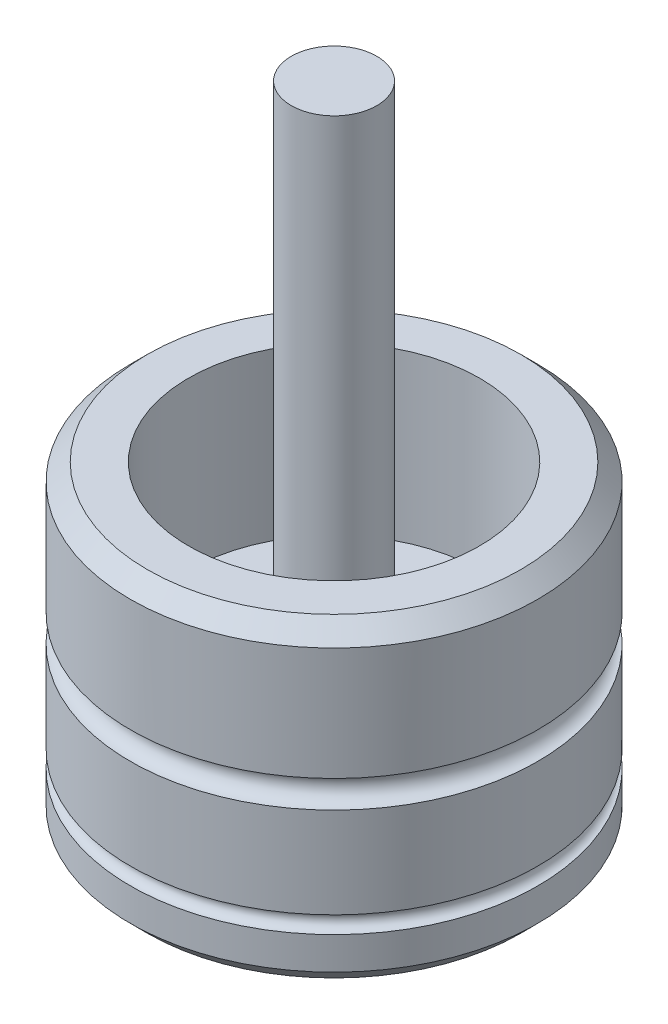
ISO-10303-21;
HEADER;
FILE_DESCRIPTION(('STEP AP214'),'2;1');
FILE_NAME('part.step','',(''),(''),'','','');
FILE_SCHEMA(('AUTOMOTIVE_DESIGN { 1 0 10303 214 1 1 1 1 }'));
ENDSEC;
DATA;
#1=APPLICATION_CONTEXT('core data for automotive mechanical design processes');
#2=APPLICATION_PROTOCOL_DEFINITION('international standard','automotive_design',2000,#1);
#3=PRODUCT_CONTEXT('',#1,'mechanical');
#4=PRODUCT('Part','Part','',(#3));
#5=PRODUCT_RELATED_PRODUCT_CATEGORY('part','',(#4));
#6=PRODUCT_DEFINITION_FORMATION('','',#4);
#7=PRODUCT_DEFINITION_CONTEXT('part definition',#1,'design');
#8=PRODUCT_DEFINITION('design','',#6,#7);
#9=PRODUCT_DEFINITION_SHAPE('','',#8);
#10=(LENGTH_UNIT() NAMED_UNIT(*) SI_UNIT(.MILLI.,.METRE.));
#11=(NAMED_UNIT(*) PLANE_ANGLE_UNIT() SI_UNIT($,.RADIAN.));
#12=(NAMED_UNIT(*) SI_UNIT($,.STERADIAN.) SOLID_ANGLE_UNIT());
#13=UNCERTAINTY_MEASURE_WITH_UNIT(LENGTH_MEASURE(1.E-05),#10,'distance_accuracy_value','');
#14=(GEOMETRIC_REPRESENTATION_CONTEXT(3) GLOBAL_UNCERTAINTY_ASSIGNED_CONTEXT((#13)) GLOBAL_UNIT_ASSIGNED_CONTEXT((#10,
#11,#12)) REPRESENTATION_CONTEXT('',''));
#15=CARTESIAN_POINT('',(0.,0.,0.));
#16=DIRECTION('',(0.,0.,1.));
#17=DIRECTION('',(1.,0.,0.));
#18=AXIS2_PLACEMENT_3D('',#15,#16,#17);
#19=CARTESIAN_POINT('',(0.,11.0264727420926,-10.7949999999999));
#20=DIRECTION('',(0.,1.,0.));
#21=DIRECTION('',(0.,0.,1.));
#22=AXIS2_PLACEMENT_3D('',#19,#20,#21);
#23=PLANE('',#22);
#24=CARTESIAN_POINT('',(0.,11.0264727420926,0.));
#25=DIRECTION('',(0.,-1.,0.));
#26=DIRECTION('',(0.,0.,-1.));
#27=AXIS2_PLACEMENT_3D('',#24,#25,#26);
#28=CIRCLE('',#27,10.795);
#29=CARTESIAN_POINT('',(0.,11.0264727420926,-10.795));
#30=VERTEX_POINT('',#29);
#31=EDGE_CURVE('E72',#30,#30,#28,.T.);
#32=ORIENTED_EDGE('',*,*,#31,.F.);
#33=EDGE_LOOP('',(#32));
#34=FACE_BOUND('',#33,.T.);
#35=CARTESIAN_POINT('',(0.,11.0264727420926,0.));
#36=DIRECTION('',(0.,1.,0.));
#37=DIRECTION('',(0.,0.,1.));
#38=AXIS2_PLACEMENT_3D('',#35,#36,#37);
#39=CIRCLE('',#38,3.175);
#40=CARTESIAN_POINT('',(0.,11.0264727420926,3.175));
#41=VERTEX_POINT('',#40);
#42=EDGE_CURVE('E76',#41,#41,#39,.T.);
#43=ORIENTED_EDGE('',*,*,#42,.F.);
#44=EDGE_LOOP('',(#43));
#45=FACE_BOUND('',#44,.T.);
#46=ADVANCED_FACE('F37',(#34,#45),#23,.T.);
#47=CARTESIAN_POINT('',(0.,0.,0.));
#48=DIRECTION('',(0.,-1.,0.));
#49=DIRECTION('',(0.,0.,-1.));
#50=AXIS2_PLACEMENT_3D('',#47,#48,#49);
#51=PLANE('',#50);
#52=CARTESIAN_POINT('',(0.,0.,0.));
#53=DIRECTION('',(0.,-1.,0.));
#54=DIRECTION('',(0.,0.,-1.));
#55=AXIS2_PLACEMENT_3D('',#52,#53,#54);
#56=CIRCLE('',#55,13.843);
#57=CARTESIAN_POINT('',(0.,0.,-13.843));
#58=VERTEX_POINT('',#57);
#59=EDGE_CURVE('E52',#58,#58,#56,.T.);
#60=ORIENTED_EDGE('',*,*,#59,.T.);
#61=EDGE_LOOP('',(#60));
#62=FACE_BOUND('',#61,.T.);
#63=ADVANCED_FACE('F91',(#62),#51,.T.);
#64=CARTESIAN_POINT('',(0.,0.,0.));
#65=DIRECTION('',(0.,-1.,0.));
#66=DIRECTION('',(0.,0.,-1.));
#67=AXIS2_PLACEMENT_3D('',#64,#65,#66);
#68=CYLINDRICAL_SURFACE('',#67,15.113);
#69=CARTESIAN_POINT('',(0.,1.27000000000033,0.));
#70=DIRECTION('',(0.,-1.,0.));
#71=DIRECTION('',(0.,0.,-1.));
#72=AXIS2_PLACEMENT_3D('',#69,#70,#71);
#73=CIRCLE('',#72,15.113);
#74=CARTESIAN_POINT('',(0.,1.27000000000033,-15.113));
#75=VERTEX_POINT('',#74);
#76=EDGE_CURVE('E48',#75,#75,#73,.F.);
#77=ORIENTED_EDGE('',*,*,#76,.T.);
#78=EDGE_LOOP('',(#77));
#79=FACE_BOUND('',#78,.T.);
#80=CARTESIAN_POINT('',(0.,3.68300000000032,0.));
#81=DIRECTION('',(0.,-1.,0.));
#82=DIRECTION('',(0.,0.,-1.));
#83=AXIS2_PLACEMENT_3D('',#80,#81,#82);
#84=CIRCLE('',#83,15.113);
#85=CARTESIAN_POINT('',(0.,3.68300000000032,-15.113));
#86=VERTEX_POINT('',#85);
#87=EDGE_CURVE('E57',#86,#86,#84,.T.);
#88=ORIENTED_EDGE('',*,*,#87,.T.);
#89=EDGE_LOOP('',(#88));
#90=FACE_BOUND('',#89,.T.);
#91=ADVANCED_FACE('F97',(#79,#90),#68,.T.);
#92=CARTESIAN_POINT('',(0.,4.31800000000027,0.));
#93=DIRECTION('',(0.,-1.,0.));
#94=DIRECTION('',(0.,0.,-1.));
#95=AXIS2_PLACEMENT_3D('',#92,#93,#94);
#96=TOROIDAL_SURFACE('',#95,15.113,0.634999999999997);
#97=CARTESIAN_POINT('',(0.,4.95300000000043,0.));
#98=DIRECTION('',(0.,-1.,0.));
#99=DIRECTION('',(0.,0.,-1.));
#100=AXIS2_PLACEMENT_3D('',#97,#98,#99);
#101=CIRCLE('',#100,15.113);
#102=CARTESIAN_POINT('',(0.,4.95300000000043,-15.113));
#103=VERTEX_POINT('',#102);
#104=EDGE_CURVE('E60',#103,#103,#101,.T.);
#105=ORIENTED_EDGE('',*,*,#104,.T.);
#106=EDGE_LOOP('',(#105));
#107=FACE_BOUND('',#106,.T.);
#108=ORIENTED_EDGE('',*,*,#87,.F.);
#109=EDGE_LOOP('',(#108));
#110=FACE_BOUND('',#109,.T.);
#111=ADVANCED_FACE('F121',(#107,#110),#96,.F.);
#112=CARTESIAN_POINT('',(0.,0.,0.));
#113=DIRECTION('',(0.,-1.,0.));
#114=DIRECTION('',(0.,0.,-1.));
#115=AXIS2_PLACEMENT_3D('',#112,#113,#114);
#116=CYLINDRICAL_SURFACE('',#115,15.113);
#117=CARTESIAN_POINT('',(0.,11.684,0.));
#118=DIRECTION('',(0.,-1.,0.));
#119=DIRECTION('',(0.,0.,-1.));
#120=AXIS2_PLACEMENT_3D('',#117,#118,#119);
#121=CIRCLE('',#120,15.113);
#122=CARTESIAN_POINT('',(0.,11.684,-15.113));
#123=VERTEX_POINT('',#122);
#124=EDGE_CURVE('E63',#123,#123,#121,.T.);
#125=ORIENTED_EDGE('',*,*,#124,.T.);
#126=EDGE_LOOP('',(#125));
#127=FACE_BOUND('',#126,.T.);
#128=ORIENTED_EDGE('',*,*,#104,.F.);
#129=EDGE_LOOP('',(#128));
#130=FACE_BOUND('',#129,.T.);
#131=ADVANCED_FACE('F117',(#127,#130),#116,.T.);
#132=CARTESIAN_POINT('',(0.,12.7000000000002,-2.22044604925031E-13));
#133=DIRECTION('',(0.,-1.,0.));
#134=DIRECTION('',(0.,0.,-1.));
#135=AXIS2_PLACEMENT_3D('',#132,#133,#134);
#136=TOROIDAL_SURFACE('',#135,15.113,1.016);
#137=CARTESIAN_POINT('',(0.,13.7160000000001,0.));
#138=DIRECTION('',(0.,-1.,0.));
#139=DIRECTION('',(0.,0.,-1.));
#140=AXIS2_PLACEMENT_3D('',#137,#138,#139);
#141=CIRCLE('',#140,15.113);
#142=CARTESIAN_POINT('',(0.,13.7160000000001,-15.113));
#143=VERTEX_POINT('',#142);
#144=EDGE_CURVE('E66',#143,#143,#141,.T.);
#145=ORIENTED_EDGE('',*,*,#144,.T.);
#146=EDGE_LOOP('',(#145));
#147=FACE_BOUND('',#146,.T.);
#148=ORIENTED_EDGE('',*,*,#124,.F.);
#149=EDGE_LOOP('',(#148));
#150=FACE_BOUND('',#149,.T.);
#151=ADVANCED_FACE('F114',(#147,#150),#136,.F.);
#152=CARTESIAN_POINT('',(0.,0.,0.));
#153=DIRECTION('',(0.,-1.,0.));
#154=DIRECTION('',(0.,0.,-1.));
#155=AXIS2_PLACEMENT_3D('',#152,#153,#154);
#156=CYLINDRICAL_SURFACE('',#155,15.113);
#157=CARTESIAN_POINT('',(0.,22.0980000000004,2.22044604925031E-13));
#158=DIRECTION('',(0.,1.,0.));
#159=DIRECTION('',(0.,0.,1.));
#160=AXIS2_PLACEMENT_3D('',#157,#158,#159);
#161=CIRCLE('',#160,15.113);
#162=CARTESIAN_POINT('',(0.,22.0980000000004,15.1130000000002));
#163=VERTEX_POINT('',#162);
#164=EDGE_CURVE('E44',#163,#163,#161,.F.);
#165=ORIENTED_EDGE('',*,*,#164,.T.);
#166=EDGE_LOOP('',(#165));
#167=FACE_BOUND('',#166,.T.);
#168=ORIENTED_EDGE('',*,*,#144,.F.);
#169=EDGE_LOOP('',(#168));
#170=FACE_BOUND('',#169,.T.);
#171=ADVANCED_FACE('F111',(#167,#170),#156,.T.);
#172=CARTESIAN_POINT('',(0.,23.3680000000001,-15.1130000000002));
#173=DIRECTION('',(0.,1.,0.));
#174=DIRECTION('',(0.,0.,1.));
#175=AXIS2_PLACEMENT_3D('',#172,#173,#174);
#176=PLANE('',#175);
#177=CARTESIAN_POINT('',(0.,23.3680000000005,0.));
#178=DIRECTION('',(0.,1.,0.));
#179=DIRECTION('',(0.,0.,1.));
#180=AXIS2_PLACEMENT_3D('',#177,#178,#179);
#181=CIRCLE('',#180,13.843);
#182=CARTESIAN_POINT('',(0.,23.3680000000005,13.843));
#183=VERTEX_POINT('',#182);
#184=EDGE_CURVE('E10',#183,#183,#181,.T.);
#185=ORIENTED_EDGE('',*,*,#184,.T.);
#186=EDGE_LOOP('',(#185));
#187=FACE_BOUND('',#186,.T.);
#188=CARTESIAN_POINT('',(0.,23.3680000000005,0.));
#189=DIRECTION('',(0.,-1.,0.));
#190=DIRECTION('',(0.,0.,-1.));
#191=AXIS2_PLACEMENT_3D('',#188,#189,#190);
#192=CIRCLE('',#191,10.795);
#193=CARTESIAN_POINT('',(0.,23.3680000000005,-10.795));
#194=VERTEX_POINT('',#193);
#195=EDGE_CURVE('E69',#194,#194,#192,.T.);
#196=ORIENTED_EDGE('',*,*,#195,.T.);
#197=EDGE_LOOP('',(#196));
#198=FACE_BOUND('',#197,.T.);
#199=ADVANCED_FACE('F107',(#187,#198),#176,.T.);
#200=CARTESIAN_POINT('',(0.,0.,0.));
#201=DIRECTION('',(0.,-1.,0.));
#202=DIRECTION('',(0.,0.,-1.));
#203=AXIS2_PLACEMENT_3D('',#200,#201,#202);
#204=CYLINDRICAL_SURFACE('',#203,10.795);
#205=ORIENTED_EDGE('',*,*,#31,.T.);
#206=EDGE_LOOP('',(#205));
#207=FACE_BOUND('',#206,.T.);
#208=ORIENTED_EDGE('',*,*,#195,.F.);
#209=EDGE_LOOP('',(#208));
#210=FACE_BOUND('',#209,.T.);
#211=ADVANCED_FACE('F103',(#207,#210),#204,.F.);
#212=CARTESIAN_POINT('',(0.,0.,0.));
#213=DIRECTION('',(0.,1.,0.));
#214=DIRECTION('',(0.,0.,1.));
#215=AXIS2_PLACEMENT_3D('',#212,#213,#214);
#216=CONICAL_SURFACE('',#215,13.843,0.785398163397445);
#217=ORIENTED_EDGE('',*,*,#76,.F.);
#218=EDGE_LOOP('',(#217));
#219=FACE_BOUND('',#218,.T.);
#220=ORIENTED_EDGE('',*,*,#59,.F.);
#221=EDGE_LOOP('',(#220));
#222=FACE_BOUND('',#221,.T.);
#223=ADVANCED_FACE('F106',(#219,#222),#216,.T.);
#224=CARTESIAN_POINT('',(0.,22.0980000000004,2.22044604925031E-13));
#225=DIRECTION('',(0.,-1.,0.));
#226=DIRECTION('',(0.,0.,-1.));
#227=AXIS2_PLACEMENT_3D('',#224,#225,#226);
#228=CONICAL_SURFACE('',#227,15.113,0.785398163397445);
#229=ORIENTED_EDGE('',*,*,#184,.F.);
#230=EDGE_LOOP('',(#229));
#231=FACE_BOUND('',#230,.T.);
#232=ORIENTED_EDGE('',*,*,#164,.F.);
#233=EDGE_LOOP('',(#232));
#234=FACE_BOUND('',#233,.T.);
#235=ADVANCED_FACE('F39',(#231,#234),#228,.T.);
#236=CARTESIAN_POINT('',(0.,47.8564727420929,0.));
#237=DIRECTION('',(0.,-1.,0.));
#238=DIRECTION('',(0.,0.,-1.));
#239=AXIS2_PLACEMENT_3D('',#236,#237,#238);
#240=CYLINDRICAL_SURFACE('',#239,3.175);
#241=CARTESIAN_POINT('',(0.,47.8564727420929,0.));
#242=DIRECTION('',(0.,1.,0.));
#243=DIRECTION('',(0.,0.,1.));
#244=AXIS2_PLACEMENT_3D('',#241,#242,#243);
#245=CIRCLE('',#244,3.175);
#246=CARTESIAN_POINT('',(0.,47.8564727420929,3.175));
#247=VERTEX_POINT('',#246);
#248=EDGE_CURVE('E75',#247,#247,#245,.T.);
#249=ORIENTED_EDGE('',*,*,#248,.F.);
#250=EDGE_LOOP('',(#249));
#251=FACE_BOUND('',#250,.T.);
#252=ORIENTED_EDGE('',*,*,#42,.T.);
#253=EDGE_LOOP('',(#252));
#254=FACE_BOUND('',#253,.T.);
#255=ADVANCED_FACE('F84',(#251,#254),#240,.T.);
#256=CARTESIAN_POINT('',(0.,47.8564727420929,0.));
#257=DIRECTION('',(0.,1.,0.));
#258=DIRECTION('',(0.,0.,1.));
#259=AXIS2_PLACEMENT_3D('',#256,#257,#258);
#260=PLANE('',#259);
#261=ORIENTED_EDGE('',*,*,#248,.T.);
#262=EDGE_LOOP('',(#261));
#263=FACE_BOUND('',#262,.T.);
#264=ADVANCED_FACE('F82',(#263),#260,.T.);
#265=CLOSED_SHELL('',(#46,#63,#91,#111,#131,#151,#171,#199,#211,#223,#235,#255,#264));
#266=MANIFOLD_SOLID_BREP('B2',#265);
#267=ADVANCED_BREP_SHAPE_REPRESENTATION('',(#18,#266),#14);
#268=SHAPE_DEFINITION_REPRESENTATION(#9,#267);
ENDSEC;
END-ISO-10303-21;
